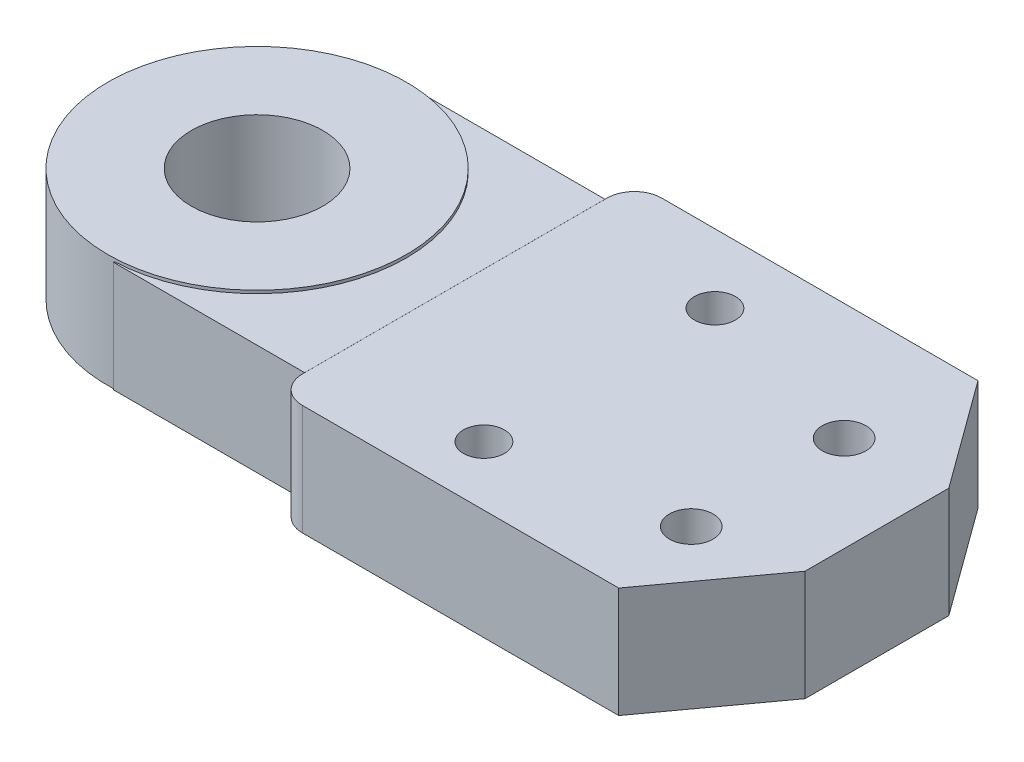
from build123d import *

# Parameters (mm, degrees)
SKETCH1_W           = 36
SKETCH1_H           = 18
BOSS_EXTRUDE1_DEPTH = 12.7
SKETCH2_R           = 25
BOSS_EXTRUDE2_DEPTH = 9.5
SKETCH3_R           = 11
CUT_EXTRUDE1_DEPTH  = 33
SKETCH4_W           = 18.902013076
SKETCH4_H           = 25.4
CUT_EXTRUDE2_DEPTH  = 54.068352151
SCALE1_SCALE        = 0.7
SCALE2_SCALE        = 0.5
SCALE3_SCALE        = 1.25
SKETCH7_W           = 11.1125
SKETCH7_H           = 8.09375
BOSS_EXTRUDE4_DEPTH = 3
SKETCH8_W           = 22
SKETCH8_H           = 8.09375
BOSS_EXTRUDE5_DEPTH = 4
SKETCH9_W           = 5.44375
SKETCH9_H           = 8.09375
BOSS_EXTRUDE6_DEPTH = 10
SKETCH10_R          = 1.5
SKETCH10_R_2        = 1.6
BOSS_EXTRUDE7_DEPTH = 8.09


with BuildPart() as part:
    # Sketch1 → Boss-Extrude1 (new, symmetric)
    with BuildSketch(Plane.XY):
        Rectangle(SKETCH1_W, SKETCH1_H)
    extrude(amount=BOSS_EXTRUDE1_DEPTH, both=True)

    # Sketch2 → Boss-Extrude2 (add, symmetric)
    with BuildSketch(Plane(origin=(0, 0, 0), x_dir=(1, 0, 0), z_dir=(0, 1, 0))):
        with Locations(Location((-18, 0, 0), (0, 0, 270))):
            Circle(SKETCH2_R)
    extrude(amount=BOSS_EXTRUDE2_DEPTH, both=True)

    # Sketch3 → Cut-Extrude1 (cut)
    with BuildSketch(Plane(origin=(0, 9.5, 0), x_dir=(1, 0, 0), z_dir=(0, 1, 0))):
        with Locations(Location((-18, 0, 0), (0, 0, 270))):
            Circle(SKETCH3_R)
    extrude(amount=-CUT_EXTRUDE1_DEPTH, mode=Mode.SUBTRACT)

    # Sketch4 → Cut-Extrude2 (cut, through all)
    with BuildSketch(Plane(origin=(0, 9, 0), x_dir=(1, 0, 0), z_dir=(0, 1, 0))):
        with Locations((8.548993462, 0)):
            Rectangle(SKETCH4_W, SKETCH4_H)
    extrude(amount=-CUT_EXTRUDE2_DEPTH, mode=Mode.SUBTRACT)


with BuildPart() as part_1:
    # Scale1: scaled about (-20.436143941, 0.029614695, 0)
    add(part.part.scale(SCALE1_SCALE).moved(Location((-6.130843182, 0.008884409, 0))))


with BuildPart() as part_2:
    # Scale2: scaled about (-20.436143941, 0.029614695, 0)
    add(part_1.part.scale(SCALE2_SCALE).moved(Location((-10.218071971, 0.014807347, 0))))


with BuildPart() as part_3:
    # Scale3: scaled about (-20.436143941, 0.029614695, 0)
    add(part_2.part.scale(SCALE3_SCALE).moved(Location((5.109035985, -0.007403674, 0))))

    # Sketch7 → Boss-Extrude4 (add)
    with BuildSketch(Plane(origin=(-11.889961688, 0, 0), x_dir=(0, 0, -1), z_dir=(1, 0, 0))):
        with Locations((0, -0.092716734)):
            Rectangle(SKETCH7_W, SKETCH7_H)
    extrude(amount=BOSS_EXTRUDE4_DEPTH)

    # Sketch8 → Boss-Extrude5 (add)
    with BuildSketch(Plane(origin=(-8.889961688, 0, 0), x_dir=(0, 0, -1), z_dir=(1, 0, 0))):
        with Locations((0, -0.092716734)):
            Rectangle(SKETCH8_W, SKETCH8_H)
    extrude(amount=BOSS_EXTRUDE5_DEPTH)

    # Sketch9 → Boss-Extrude6 (add)
    with BuildSketch(Plane.ZY.offset(8.889961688)):
        with Locations((8.278125, -0.092716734)):
            Rectangle(SKETCH9_W, SKETCH9_H)
        with Locations((-8.278125, -0.092716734)):
            Rectangle(SKETCH9_W, SKETCH9_H)
    extrude(amount=BOSS_EXTRUDE6_DEPTH)

    # Sketch10 → Boss-Extrude7 (add)
    with BuildSketch(Plane.XZ.offset(4.139591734)):
        with BuildLine():
            Line((26.030302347, 5.266475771), (26.030302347, -5.266475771))
            Line((26.030302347, -5.266475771), (20.278952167, -13.156822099))
            Line((20.278952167, -13.156822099), (-2.889961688, -13.156822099))
            ThreePointArc((-2.889961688, -13.156822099), (-4.30417525, -12.571035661), (-4.889961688, -11.156822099))
            Line((-4.889961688, -11.156822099), (-4.889961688, -11))
            Line((-4.889961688, -11), (-4.889961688, 11))
            Line((-4.889961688, 11), (-4.889961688, 11.156822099))
            ThreePointArc((-4.889961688, 11.156822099), (-4.30417525, 12.571035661), (-2.889961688, 13.156822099))
            Line((-2.889961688, 13.156822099), (20.276803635, 13.156822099))
            Line((20.276803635, 13.156822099), (26.030302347, 5.266475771))
        make_face()
        with Locations(Location((6.052482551, -8.112368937, 0), (0, 0, 270))):
            Circle(SKETCH10_R, mode=Mode.SUBTRACT)
        with Locations(Location((6.052482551, 8.808807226, 0), (0, 0, 270))):
            Circle(SKETCH10_R, mode=Mode.SUBTRACT)
        with Locations(Location((19.0301497, -4.6, 0), (0, 0, 270))):
            Circle(SKETCH10_R_2, mode=Mode.SUBTRACT)
        with Locations(Location((19.0301497, 6.6, 0), (0, 0, 270))):
            Circle(SKETCH10_R_2, mode=Mode.SUBTRACT)
    extrude(amount=-BOSS_EXTRUDE7_DEPTH)


solid = part_3.part
